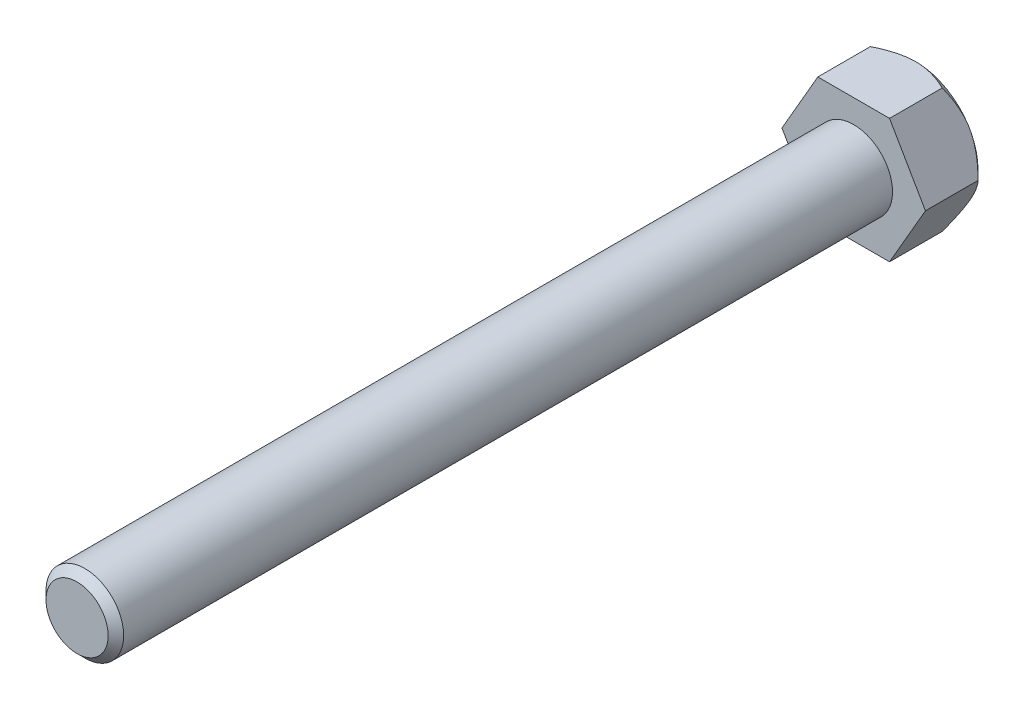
ISO-10303-21;
HEADER;
FILE_DESCRIPTION(('STEP AP214'),'2;1');
FILE_NAME('part.step','',(''),(''),'','','');
FILE_SCHEMA(('AUTOMOTIVE_DESIGN { 1 0 10303 214 1 1 1 1 }'));
ENDSEC;
DATA;
#1=APPLICATION_CONTEXT('core data for automotive mechanical design processes');
#2=APPLICATION_PROTOCOL_DEFINITION('international standard','automotive_design',2000,#1);
#3=PRODUCT_CONTEXT('',#1,'mechanical');
#4=PRODUCT('Part','Part','',(#3));
#5=PRODUCT_RELATED_PRODUCT_CATEGORY('part','',(#4));
#6=PRODUCT_DEFINITION_FORMATION('','',#4);
#7=PRODUCT_DEFINITION_CONTEXT('part definition',#1,'design');
#8=PRODUCT_DEFINITION('design','',#6,#7);
#9=PRODUCT_DEFINITION_SHAPE('','',#8);
#10=(LENGTH_UNIT() NAMED_UNIT(*) SI_UNIT(.MILLI.,.METRE.));
#11=(NAMED_UNIT(*) PLANE_ANGLE_UNIT() SI_UNIT($,.RADIAN.));
#12=(NAMED_UNIT(*) SI_UNIT($,.STERADIAN.) SOLID_ANGLE_UNIT());
#13=UNCERTAINTY_MEASURE_WITH_UNIT(LENGTH_MEASURE(1.E-05),#10,'distance_accuracy_value','');
#14=(GEOMETRIC_REPRESENTATION_CONTEXT(3) GLOBAL_UNCERTAINTY_ASSIGNED_CONTEXT((#13)) GLOBAL_UNIT_ASSIGNED_CONTEXT((#10,
#11,#12)) REPRESENTATION_CONTEXT('',''));
#15=CARTESIAN_POINT('',(0.,0.,0.));
#16=DIRECTION('',(0.,0.,1.));
#17=DIRECTION('',(1.,0.,0.));
#18=AXIS2_PLACEMENT_3D('',#15,#16,#17);
#19=CARTESIAN_POINT('',(2.3094010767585,-4.00000000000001,4.));
#20=DIRECTION('',(-0.866025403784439,0.5,0.));
#21=DIRECTION('',(-0.5,-0.866025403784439,0.));
#22=AXIS2_PLACEMENT_3D('',#19,#20,#21);
#23=PLANE('',#22);
#24=CARTESIAN_POINT('',(6.23305633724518,2.79597026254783,2.82801284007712));
#25=CARTESIAN_POINT('',(6.17835989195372,2.7012332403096,2.73934369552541));
#26=CARTESIAN_POINT('',(6.12344684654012,2.60612105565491,2.6512041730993));
#27=CARTESIAN_POINT('',(6.01311260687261,2.4150165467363,2.47618696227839));
#28=CARTESIAN_POINT('',(5.95769136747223,2.3190241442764,2.38930938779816));
#29=CARTESIAN_POINT('',(5.8461445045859,2.12581931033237,2.21683197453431));
#30=CARTESIAN_POINT('',(5.79001753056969,2.02860453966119,2.13123562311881));
#31=CARTESIAN_POINT('',(5.67710269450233,1.83303030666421,1.96180822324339));
#32=CARTESIAN_POINT('',(5.62031485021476,1.73467087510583,1.87797712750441));
#33=CARTESIAN_POINT('',(5.50440203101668,1.5339039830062,1.71013938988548));
#34=CARTESIAN_POINT('',(5.4452557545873,1.43145962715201,1.62619145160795));
#35=CARTESIAN_POINT('',(5.32603106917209,1.22495641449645,1.4609883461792));
#36=CARTESIAN_POINT('',(5.26595269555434,1.1208976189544,1.37973307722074));
#37=CARTESIAN_POINT('',(5.14476310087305,0.910991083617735,1.22057920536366));
#38=CARTESIAN_POINT('',(5.08365279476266,0.805144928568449,1.14267782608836));
#39=CARTESIAN_POINT('',(4.96018805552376,0.591297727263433,0.99094029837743));
#40=CARTESIAN_POINT('',(4.8978337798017,0.483296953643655,0.917103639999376));
#41=CARTESIAN_POINT('',(4.76998399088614,0.261854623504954,0.772552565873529));
#42=CARTESIAN_POINT('',(4.70444912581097,0.148344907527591,0.701976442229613));
#43=CARTESIAN_POINT('',(4.57165447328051,-0.0816621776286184,0.56753175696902));
#44=CARTESIAN_POINT('',(4.50439444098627,-0.198159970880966,0.503664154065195));
#45=CARTESIAN_POINT('',(4.36836758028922,-0.433765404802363,0.384737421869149));
#46=CARTESIAN_POINT('',(4.29961082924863,-0.552855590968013,0.3296326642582));
#47=CARTESIAN_POINT('',(4.16020651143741,-0.794310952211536,0.229941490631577));
#48=CARTESIAN_POINT('',(4.08955952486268,-0.916675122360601,0.185351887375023));
#49=CARTESIAN_POINT('',(3.96058423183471,-1.14006688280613,0.116499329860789));
#50=CARTESIAN_POINT('',(3.90256086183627,-1.24056630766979,0.0899643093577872));
#51=CARTESIAN_POINT('',(3.78562938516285,-1.44309756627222,0.0463155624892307));
#52=CARTESIAN_POINT('',(3.72672140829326,-1.54512917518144,0.0292004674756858));
#53=CARTESIAN_POINT('',(3.60848332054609,-1.74992355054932,0.00527037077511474));
#54=CARTESIAN_POINT('',(3.5491541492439,-1.85268468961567,-0.00156293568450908));
#55=CARTESIAN_POINT('',(3.43042577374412,-2.0583282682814,-0.00461227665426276));
#56=CARTESIAN_POINT('',(3.37102656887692,-2.16121070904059,-0.000828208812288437));
#57=CARTESIAN_POINT('',(3.25278300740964,-2.36601456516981,0.017123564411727));
#58=CARTESIAN_POINT('',(3.19393761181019,-2.46793778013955,0.0312643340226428));
#59=CARTESIAN_POINT('',(3.07702437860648,-2.67043744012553,0.0691728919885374));
#60=CARTESIAN_POINT('',(3.01895672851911,-2.77101356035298,0.0929429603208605));
#61=CARTESIAN_POINT('',(2.90370727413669,-2.97063147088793,0.149127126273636));
#62=CARTESIAN_POINT('',(2.84652859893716,-3.06966784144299,0.181566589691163));
#63=CARTESIAN_POINT('',(2.73337155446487,-3.26566159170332,0.253854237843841));
#64=CARTESIAN_POINT('',(2.67739312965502,-3.36261906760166,0.293702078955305));
#65=CARTESIAN_POINT('',(2.54711533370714,-3.58826682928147,0.394806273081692));
#66=CARTESIAN_POINT('',(2.47332098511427,-3.71608239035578,0.458655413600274));
#67=CARTESIAN_POINT('',(2.32781431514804,-3.96810733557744,0.595286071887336));
#68=CARTESIAN_POINT('',(2.25610311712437,-4.09231477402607,0.668072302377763));
#69=CARTESIAN_POINT('',(2.11441297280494,-4.33772930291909,0.820726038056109));
#70=CARTESIAN_POINT('',(2.04443792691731,-4.45892963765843,0.900607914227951));
#71=CARTESIAN_POINT('',(1.90613088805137,-4.69848445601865,1.06578250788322));
#72=CARTESIAN_POINT('',(1.83779860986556,-4.8168394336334,1.15107427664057));
#73=CARTESIAN_POINT('',(1.70220901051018,-5.05168750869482,1.32633967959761));
#74=CARTESIAN_POINT('',(1.63495814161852,-5.16816943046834,1.41633318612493));
#75=CARTESIAN_POINT('',(1.50163856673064,-5.39908570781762,1.59976782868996));
#76=CARTESIAN_POINT('',(1.43556996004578,-5.51351989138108,1.69320925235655));
#77=CARTESIAN_POINT('',(1.30451081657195,-5.74052098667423,1.88276529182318));
#78=CARTESIAN_POINT('',(1.23951918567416,-5.85308979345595,1.97887689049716));
#79=CARTESIAN_POINT('',(1.11038848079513,-6.07675073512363,2.17336534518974));
#80=CARTESIAN_POINT('',(1.0462494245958,-6.18784283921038,2.27174224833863));
#81=CARTESIAN_POINT('',(0.934092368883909,-6.3821045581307,2.44639645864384));
#82=CARTESIAN_POINT('',(0.885919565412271,-6.46554230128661,2.52227719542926));
#83=CARTESIAN_POINT('',(0.790160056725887,-6.63140263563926,2.67464512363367));
#84=CARTESIAN_POINT('',(0.742571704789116,-6.71382807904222,2.75112817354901));
#85=CARTESIAN_POINT('',(0.695146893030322,-6.79597026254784,2.82801284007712));
#86=B_SPLINE_CURVE_WITH_KNOTS('',3,(#24,#25,#26,#27,#28,#29,#30,#31,#32,#33,#34,#35,#36,#37,#38,
#39,#40,#41,#42,#43,#44,#45,#46,#47,#48,#49,#50,#51,#52,#53,#54,#55,#56,#57,#58,#59,#60,#61,#62,
#63,#64,#65,#66,#67,#68,#69,#70,#71,#72,#73,#74,#75,#76,#77,#78,#79,#80,#81,#82,#83,#84,#85),
.UNSPECIFIED.,.F.,.F.,(4,2,2,2,2,2,2,2,2,2,2,2,2,2,2,2,2,2,2,2,2,2,2,2,2,2,2,2,2,2,4),(0.,
0.422449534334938,0.84493696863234,1.26841847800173,1.6918886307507,2.1270169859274,
2.56212887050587,2.99687335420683,3.43156317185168,3.87799967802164,4.32449989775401,
4.76859314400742,5.21255160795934,5.56933787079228,5.92607228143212,6.2821708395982,
6.63827283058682,6.99345194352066,7.34871520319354,7.70502952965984,8.06132733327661,
8.54334615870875,9.02562026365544,9.50889442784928,9.99208407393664,10.4775138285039,
10.9629841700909,11.4479266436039,11.9328792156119,12.3007909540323,12.6670827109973),.UNSPECIFIED.);
#87=CARTESIAN_POINT('',(4.61880215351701,0.,0.615384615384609));
#88=VERTEX_POINT('',#87);
#89=CARTESIAN_POINT('',(3.54679379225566,-1.8567729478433,0.));
#90=VERTEX_POINT('',#89);
#91=EDGE_CURVE('E194',#88,#90,#86,.T.);
#92=ORIENTED_EDGE('',*,*,#91,.F.);
#93=DIRECTION('',(0.,0.,-1.));
#94=VECTOR('',#93,1.);
#95=CARTESIAN_POINT('',(4.61880215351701,0.,4.));
#96=LINE('',#95,#94);
#97=CARTESIAN_POINT('',(4.61880215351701,0.,4.));
#98=VERTEX_POINT('',#97);
#99=EDGE_CURVE('E161',#98,#88,#96,.T.);
#100=ORIENTED_EDGE('',*,*,#99,.F.);
#101=DIRECTION('',(0.5,0.866025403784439,0.));
#102=VECTOR('',#101,1.);
#103=CARTESIAN_POINT('',(2.3094010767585,-4.00000000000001,4.));
#104=LINE('',#103,#102);
#105=CARTESIAN_POINT('',(2.3094010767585,-4.00000000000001,4.));
#106=VERTEX_POINT('',#105);
#107=EDGE_CURVE('E216',#106,#98,#104,.T.);
#108=ORIENTED_EDGE('',*,*,#107,.F.);
#109=DIRECTION('',(0.,0.,-1.));
#110=VECTOR('',#109,1.);
#111=CARTESIAN_POINT('',(2.3094010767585,-4.00000000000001,4.));
#112=LINE('',#111,#110);
#113=CARTESIAN_POINT('',(2.30940107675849,-4.00000000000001,0.615384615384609));
#114=VERTEX_POINT('',#113);
#115=EDGE_CURVE('E155',#106,#114,#112,.T.);
#116=ORIENTED_EDGE('',*,*,#115,.T.);
#117=CARTESIAN_POINT('',(3.38140943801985,-2.1432270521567,0.));
#118=VERTEX_POINT('',#117);
#119=EDGE_CURVE('E129',#118,#114,#86,.T.);
#120=ORIENTED_EDGE('',*,*,#119,.F.);
#121=DIRECTION('',(0.5,0.866025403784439,0.));
#122=VECTOR('',#121,1.);
#123=CARTESIAN_POINT('',(2.3094010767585,-4.00000000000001,0.));
#124=LINE('',#123,#122);
#125=EDGE_CURVE('E190',#118,#90,#124,.T.);
#126=ORIENTED_EDGE('',*,*,#125,.T.);
#127=EDGE_LOOP('',(#92,#100,#108,#116,#120,#126));
#128=FACE_BOUND('',#127,.T.);
#129=ADVANCED_FACE('F31',(#128),#23,.F.);
#130=CARTESIAN_POINT('',(4.61880215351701,0.,4.));
#131=DIRECTION('',(-0.866025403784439,-0.5,0.));
#132=DIRECTION('',(0.5,-0.866025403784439,0.));
#133=AXIS2_PLACEMENT_3D('',#130,#131,#132);
#134=PLANE('',#133);
#135=CARTESIAN_POINT('',(0.695146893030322,6.79597026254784,2.82801284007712));
#136=CARTESIAN_POINT('',(0.749843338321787,6.70123324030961,2.73934369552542));
#137=CARTESIAN_POINT('',(0.804756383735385,6.60612105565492,2.65120417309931));
#138=CARTESIAN_POINT('',(0.915090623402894,6.41501654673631,2.4761869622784));
#139=CARTESIAN_POINT('',(0.97051186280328,6.31902414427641,2.38930938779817));
#140=CARTESIAN_POINT('',(1.0820587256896,6.12581931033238,2.21683197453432));
#141=CARTESIAN_POINT('',(1.13818569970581,6.02860453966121,2.13123562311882));
#142=CARTESIAN_POINT('',(1.25110053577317,5.83303030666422,1.9618082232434));
#143=CARTESIAN_POINT('',(1.30788838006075,5.73467087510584,1.87797712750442));
#144=CARTESIAN_POINT('',(1.42380119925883,5.53390398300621,1.71013938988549));
#145=CARTESIAN_POINT('',(1.4829474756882,5.43145962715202,1.62619145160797));
#146=CARTESIAN_POINT('',(1.60217216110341,5.22495641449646,1.46098834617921));
#147=CARTESIAN_POINT('',(1.66225053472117,5.12089761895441,1.37973307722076));
#148=CARTESIAN_POINT('',(1.78344012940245,4.91099108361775,1.22057920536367));
#149=CARTESIAN_POINT('',(1.84455043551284,4.80514492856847,1.14267782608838));
#150=CARTESIAN_POINT('',(1.96801517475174,4.59129772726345,0.990940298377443));
#151=CARTESIAN_POINT('',(2.0303694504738,4.48329695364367,0.917103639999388));
#152=CARTESIAN_POINT('',(2.15821923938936,4.26185462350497,0.77255256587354));
#153=CARTESIAN_POINT('',(2.22375410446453,4.14834490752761,0.701976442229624));
#154=CARTESIAN_POINT('',(2.35654875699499,3.9183378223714,0.56753175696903));
#155=CARTESIAN_POINT('',(2.42380878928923,3.80184002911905,0.503664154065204));
#156=CARTESIAN_POINT('',(2.55983564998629,3.56623459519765,0.384737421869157));
#157=CARTESIAN_POINT('',(2.62859240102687,3.447144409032,0.329632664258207));
#158=CARTESIAN_POINT('',(2.7679967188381,3.20568904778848,0.229941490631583));
#159=CARTESIAN_POINT('',(2.83864370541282,3.08332487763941,0.185351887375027));
#160=CARTESIAN_POINT('',(2.9676189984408,2.85993311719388,0.116499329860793));
#161=CARTESIAN_POINT('',(3.02564236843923,2.75943369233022,0.0899643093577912));
#162=CARTESIAN_POINT('',(3.14257384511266,2.55690243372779,0.046315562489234));
#163=CARTESIAN_POINT('',(3.20148182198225,2.45487082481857,0.0292004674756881));
#164=CARTESIAN_POINT('',(3.31971990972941,2.25007644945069,0.00527037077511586));
#165=CARTESIAN_POINT('',(3.3790490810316,2.14731531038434,-0.00156293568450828));
#166=CARTESIAN_POINT('',(3.49777745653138,1.94167173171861,-0.00461227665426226));
#167=CARTESIAN_POINT('',(3.55717666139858,1.83878929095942,-0.000828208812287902));
#168=CARTESIAN_POINT('',(3.67542022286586,1.6339854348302,0.0171235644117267));
#169=CARTESIAN_POINT('',(3.73426561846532,1.53206221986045,0.0312643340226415));
#170=CARTESIAN_POINT('',(3.85117885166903,1.32956255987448,0.0691728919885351));
#171=CARTESIAN_POINT('',(3.9092465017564,1.22898643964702,0.0929429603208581));
#172=CARTESIAN_POINT('',(4.02449595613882,1.02936852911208,0.149127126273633));
#173=CARTESIAN_POINT('',(4.08167463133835,0.930332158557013,0.181566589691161));
#174=CARTESIAN_POINT('',(4.19483167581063,0.734338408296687,0.253854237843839));
#175=CARTESIAN_POINT('',(4.25081010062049,0.637380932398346,0.293702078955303));
#176=CARTESIAN_POINT('',(4.38108789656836,0.411733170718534,0.394806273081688));
#177=CARTESIAN_POINT('',(4.45488224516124,0.283917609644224,0.458655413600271));
#178=CARTESIAN_POINT('',(4.60038891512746,0.0318926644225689,0.595286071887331));
#179=CARTESIAN_POINT('',(4.67210011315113,-0.0923147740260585,0.668072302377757));
#180=CARTESIAN_POINT('',(4.81379025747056,-0.337729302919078,0.820726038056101));
#181=CARTESIAN_POINT('',(4.88376530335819,-0.458929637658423,0.900607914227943));
#182=CARTESIAN_POINT('',(5.02207234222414,-0.69848445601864,1.06578250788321));
#183=CARTESIAN_POINT('',(5.09040462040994,-0.816839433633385,1.15107427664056));
#184=CARTESIAN_POINT('',(5.22599421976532,-1.05168750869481,1.3263396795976));
#185=CARTESIAN_POINT('',(5.29324508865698,-1.16816943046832,1.41633318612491));
#186=CARTESIAN_POINT('',(5.42656466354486,-1.3990857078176,1.59976782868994));
#187=CARTESIAN_POINT('',(5.49263327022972,-1.51351989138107,1.69320925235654));
#188=CARTESIAN_POINT('',(5.62369241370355,-1.74052098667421,1.88276529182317));
#189=CARTESIAN_POINT('',(5.68868404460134,-1.85308979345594,1.97887689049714));
#190=CARTESIAN_POINT('',(5.81781474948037,-2.07675073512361,2.17336534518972));
#191=CARTESIAN_POINT('',(5.8819538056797,-2.18784283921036,2.27174224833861));
#192=CARTESIAN_POINT('',(5.99411086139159,-2.38210455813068,2.44639645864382));
#193=CARTESIAN_POINT('',(6.04228366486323,-2.46554230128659,2.52227719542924));
#194=CARTESIAN_POINT('',(6.13804317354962,-2.63140263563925,2.67464512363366));
#195=CARTESIAN_POINT('',(6.18563152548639,-2.71382807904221,2.751128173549));
#196=CARTESIAN_POINT('',(6.23305633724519,-2.79597026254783,2.82801284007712));
#197=B_SPLINE_CURVE_WITH_KNOTS('',3,(#135,#136,#137,#138,#139,#140,#141,#142,#143,#144,#145,
#146,#147,#148,#149,#150,#151,#152,#153,#154,#155,#156,#157,#158,#159,#160,#161,#162,#163,#164,
#165,#166,#167,#168,#169,#170,#171,#172,#173,#174,#175,#176,#177,#178,#179,#180,#181,#182,#183,
#184,#185,#186,#187,#188,#189,#190,#191,#192,#193,#194,#195,#196),.UNSPECIFIED.,.F.,.F.,(4,2,2,
2,2,2,2,2,2,2,2,2,2,2,2,2,2,2,2,2,2,2,2,2,2,2,2,2,2,2,4),(0.,0.422449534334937,
0.844936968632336,1.26841847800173,1.6918886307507,2.12701698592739,2.56212887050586,
2.99687335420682,3.43156317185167,3.87799967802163,4.32449989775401,4.76859314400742,
5.21255160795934,5.56933787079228,5.92607228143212,6.2821708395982,6.63827283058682,
6.99345194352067,7.34871520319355,7.70502952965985,8.06132733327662,8.54334615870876,
9.02562026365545,9.50889442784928,9.99208407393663,10.4775138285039,10.9629841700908,
11.4479266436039,11.9328792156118,12.3007909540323,12.6670827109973),.UNSPECIFIED.);
#198=CARTESIAN_POINT('',(2.30940107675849,4.00000000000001,0.615384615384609));
#199=VERTEX_POINT('',#198);
#200=CARTESIAN_POINT('',(3.38140943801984,2.14322705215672,0.));
#201=VERTEX_POINT('',#200);
#202=EDGE_CURVE('E46',#199,#201,#197,.T.);
#203=ORIENTED_EDGE('',*,*,#202,.F.);
#204=DIRECTION('',(0.,0.,-1.));
#205=VECTOR('',#204,1.);
#206=CARTESIAN_POINT('',(2.3094010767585,4.00000000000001,4.));
#207=LINE('',#206,#205);
#208=CARTESIAN_POINT('',(2.3094010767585,4.00000000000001,4.));
#209=VERTEX_POINT('',#208);
#210=EDGE_CURVE('E152',#209,#199,#207,.T.);
#211=ORIENTED_EDGE('',*,*,#210,.F.);
#212=DIRECTION('',(-0.5,0.866025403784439,0.));
#213=VECTOR('',#212,1.);
#214=CARTESIAN_POINT('',(4.61880215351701,0.,4.));
#215=LINE('',#214,#213);
#216=EDGE_CURVE('E225',#98,#209,#215,.T.);
#217=ORIENTED_EDGE('',*,*,#216,.F.);
#218=ORIENTED_EDGE('',*,*,#99,.T.);
#219=CARTESIAN_POINT('',(3.54679379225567,1.85677294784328,0.));
#220=VERTEX_POINT('',#219);
#221=EDGE_CURVE('E234',#220,#88,#197,.T.);
#222=ORIENTED_EDGE('',*,*,#221,.F.);
#223=DIRECTION('',(-0.5,0.866025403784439,0.));
#224=VECTOR('',#223,1.);
#225=CARTESIAN_POINT('',(4.61880215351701,0.,0.));
#226=LINE('',#225,#224);
#227=EDGE_CURVE('E198',#220,#201,#226,.T.);
#228=ORIENTED_EDGE('',*,*,#227,.T.);
#229=EDGE_LOOP('',(#203,#211,#217,#218,#222,#228));
#230=FACE_BOUND('',#229,.T.);
#231=ADVANCED_FACE('F240',(#230),#134,.F.);
#232=CARTESIAN_POINT('',(2.3094010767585,4.00000000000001,4.));
#233=DIRECTION('',(0.,-1.,0.));
#234=DIRECTION('',(1.,0.,0.));
#235=AXIS2_PLACEMENT_3D('',#232,#233,#234);
#236=PLANE('',#235);
#237=CARTESIAN_POINT('',(-5.10537133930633,4.00000000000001,2.48232193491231));
#238=CARTESIAN_POINT('',(-4.99107134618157,4.00000000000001,2.39236445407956));
#239=CARTESIAN_POINT('',(-4.87622346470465,4.00000000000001,2.30309422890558));
#240=CARTESIAN_POINT('',(-4.64522047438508,4.00000000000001,2.12622342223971));
#241=CARTESIAN_POINT('',(-4.52906515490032,4.00000000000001,2.03862311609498));
#242=CARTESIAN_POINT('',(-4.29468593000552,4.00000000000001,1.86498189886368));
#243=CARTESIAN_POINT('',(-4.17645456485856,4.00000000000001,1.77895103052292));
#244=CARTESIAN_POINT('',(-3.93826053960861,4.00000000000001,1.60932693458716));
#245=CARTESIAN_POINT('',(-3.81829796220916,4.00000000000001,1.52573359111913));
#246=CARTESIAN_POINT('',(-3.57038197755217,4.00000000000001,1.35745298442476));
#247=CARTESIAN_POINT('',(-3.44232649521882,4.00000000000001,1.27291553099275));
#248=CARTESIAN_POINT('',(-3.18362899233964,4.00000000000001,1.10790004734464));
#249=CARTESIAN_POINT('',(-3.05298718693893,4.00000000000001,1.0274216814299));
#250=CARTESIAN_POINT('',(-2.78893252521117,4.00000000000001,0.871702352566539));
#251=CARTESIAN_POINT('',(-2.6555253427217,4.00000000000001,0.796451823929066));
#252=CARTESIAN_POINT('',(-2.38529285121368,4.00000000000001,0.652391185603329));
#253=CARTESIAN_POINT('',(-2.24846847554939,4.00000000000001,0.583579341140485));
#254=CARTESIAN_POINT('',(-1.98529180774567,4.00000000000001,0.460804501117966));
#255=CARTESIAN_POINT('',(-1.85931525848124,4.00000000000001,0.40604199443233));
#256=CARTESIAN_POINT('',(-1.60408237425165,4.00000000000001,0.304641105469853));
#257=CARTESIAN_POINT('',(-1.4748257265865,4.00000000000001,0.258003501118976));
#258=CARTESIAN_POINT('',(-1.21458926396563,4.00000000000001,0.175122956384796));
#259=CARTESIAN_POINT('',(-1.08364549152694,4.00000000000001,0.13876837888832));
#260=CARTESIAN_POINT('',(-0.819107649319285,4.00000000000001,0.077563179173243));
#261=CARTESIAN_POINT('',(-0.685514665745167,4.00000000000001,0.0527079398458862));
#262=CARTESIAN_POINT('',(-0.41398619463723,4.00000000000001,0.0156595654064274));
#263=CARTESIAN_POINT('',(-0.276016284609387,4.00000000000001,0.00371325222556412));
#264=CARTESIAN_POINT('',(0.000415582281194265,4.00000000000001,-0.00580250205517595));
#265=CARTESIAN_POINT('',(0.138877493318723,4.00000000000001,-0.00337324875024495));
#266=CARTESIAN_POINT('',(0.415213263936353,4.00000000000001,0.0157037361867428));
#267=CARTESIAN_POINT('',(0.553084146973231,4.00000000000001,0.032393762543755));
#268=CARTESIAN_POINT('',(0.826587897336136,4.00000000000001,0.0788679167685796));
#269=CARTESIAN_POINT('',(0.962220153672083,4.00000000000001,0.108655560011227));
#270=CARTESIAN_POINT('',(1.27145954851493,4.00000000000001,0.190396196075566));
#271=CARTESIAN_POINT('',(1.44400277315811,4.00000000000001,0.246341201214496));
#272=CARTESIAN_POINT('',(1.78341610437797,4.00000000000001,0.373308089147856));
#273=CARTESIAN_POINT('',(1.95028276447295,4.00000000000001,0.444338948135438));
#274=CARTESIAN_POINT('',(2.27983021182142,4.00000000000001,0.598348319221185));
#275=CARTESIAN_POINT('',(2.44247121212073,4.00000000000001,0.681410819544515));
#276=CARTESIAN_POINT('',(2.76293118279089,4.00000000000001,0.856187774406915));
#277=CARTESIAN_POINT('',(2.92075125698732,4.00000000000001,0.947900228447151));
#278=CARTESIAN_POINT('',(3.25568101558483,4.00000000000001,1.15209259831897));
#279=CARTESIAN_POINT('',(3.43214379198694,4.00000000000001,1.26562664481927));
#280=CARTESIAN_POINT('',(3.78080075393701,4.00000000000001,1.49910125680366));
#281=CARTESIAN_POINT('',(3.95299395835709,4.00000000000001,1.6190432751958));
#282=CARTESIAN_POINT('',(4.29008176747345,4.00000000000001,1.8609963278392));
#283=CARTESIAN_POINT('',(4.45505343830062,4.00000000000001,1.98290043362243));
#284=CARTESIAN_POINT('',(4.7004233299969,4.00000000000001,2.16838347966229));
#285=CARTESIAN_POINT('',(4.78183731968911,4.00000000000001,2.23062680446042));
#286=CARTESIAN_POINT('',(4.944049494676,4.00000000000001,2.35590440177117));
#287=CARTESIAN_POINT('',(5.02484770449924,4.00000000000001,2.41893864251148));
#288=CARTESIAN_POINT('',(5.10537133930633,4.00000000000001,2.48232193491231));
#289=B_SPLINE_CURVE_WITH_KNOTS('',3,(#237,#238,#239,#240,#241,#242,#243,#244,#245,#246,#247,
#248,#249,#250,#251,#252,#253,#254,#255,#256,#257,#258,#259,#260,#261,#262,#263,#264,#265,#266,
#267,#268,#269,#270,#271,#272,#273,#274,#275,#276,#277,#278,#279,#280,#281,#282,#283,#284,#285,
#286,#287,#288),.UNSPECIFIED.,.F.,.F.,(4,2,2,2,2,2,2,2,2,2,2,2,2,2,2,2,2,2,2,2,2,2,2,2,2,4),(0.,
0.436367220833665,0.872805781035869,1.31143651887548,1.7500463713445,2.21031446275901,
2.67054442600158,3.12990880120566,3.58914905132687,4.00101511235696,4.41292058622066,
4.82016568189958,5.22724712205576,5.64198138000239,6.05667797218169,6.4726087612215,
6.8886512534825,7.43185630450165,7.97538547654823,8.52291009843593,9.07030840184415,
9.69960915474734,10.3290532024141,10.9443638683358,11.2518047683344,11.5592333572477),.UNSPECIFIED.);
#290=CARTESIAN_POINT('',(-2.30940107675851,3.99999999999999,0.615384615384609));
#291=VERTEX_POINT('',#290);
#292=CARTESIAN_POINT('',(-0.16538435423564,4.00000000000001,0.));
#293=VERTEX_POINT('',#292);
#294=EDGE_CURVE('E54',#291,#293,#289,.T.);
#295=ORIENTED_EDGE('',*,*,#294,.F.);
#296=DIRECTION('',(0.,0.,-1.));
#297=VECTOR('',#296,1.);
#298=CARTESIAN_POINT('',(-2.3094010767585,4.00000000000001,4.));
#299=LINE('',#298,#297);
#300=CARTESIAN_POINT('',(-2.3094010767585,4.00000000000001,4.));
#301=VERTEX_POINT('',#300);
#302=EDGE_CURVE('E148',#301,#291,#299,.T.);
#303=ORIENTED_EDGE('',*,*,#302,.F.);
#304=DIRECTION('',(-1.,0.,0.));
#305=VECTOR('',#304,1.);
#306=CARTESIAN_POINT('',(2.3094010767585,4.00000000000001,4.));
#307=LINE('',#306,#305);
#308=EDGE_CURVE('E221',#209,#301,#307,.T.);
#309=ORIENTED_EDGE('',*,*,#308,.F.);
#310=ORIENTED_EDGE('',*,*,#210,.T.);
#311=CARTESIAN_POINT('',(0.165384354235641,4.00000000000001,0.));
#312=VERTEX_POINT('',#311);
#313=EDGE_CURVE('E235',#312,#199,#289,.T.);
#314=ORIENTED_EDGE('',*,*,#313,.F.);
#315=DIRECTION('',(-1.,0.,0.));
#316=VECTOR('',#315,1.);
#317=CARTESIAN_POINT('',(2.3094010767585,4.00000000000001,0.));
#318=LINE('',#317,#316);
#319=EDGE_CURVE('E202',#312,#293,#318,.T.);
#320=ORIENTED_EDGE('',*,*,#319,.T.);
#321=EDGE_LOOP('',(#295,#303,#309,#310,#314,#320));
#322=FACE_BOUND('',#321,.T.);
#323=ADVANCED_FACE('F275',(#322),#236,.F.);
#324=CARTESIAN_POINT('',(-2.3094010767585,4.00000000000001,4.));
#325=DIRECTION('',(0.866025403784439,-0.5,0.));
#326=DIRECTION('',(0.5,0.866025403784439,0.));
#327=AXIS2_PLACEMENT_3D('',#324,#325,#326);
#328=PLANE('',#327);
#329=CARTESIAN_POINT('',(-6.23305633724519,-2.79597026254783,2.82801284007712));
#330=CARTESIAN_POINT('',(-6.17835989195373,-2.7012332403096,2.73934369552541));
#331=CARTESIAN_POINT('',(-6.12344684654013,-2.60612105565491,2.65120417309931));
#332=CARTESIAN_POINT('',(-6.01311260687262,-2.4150165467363,2.4761869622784));
#333=CARTESIAN_POINT('',(-5.95769136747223,-2.3190241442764,2.38930938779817));
#334=CARTESIAN_POINT('',(-5.84614450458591,-2.12581931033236,2.21683197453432));
#335=CARTESIAN_POINT('',(-5.7900175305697,-2.02860453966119,2.13123562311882));
#336=CARTESIAN_POINT('',(-5.67710269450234,-1.83303030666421,1.9618082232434));
#337=CARTESIAN_POINT('',(-5.62031485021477,-1.73467087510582,1.87797712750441));
#338=CARTESIAN_POINT('',(-5.50440203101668,-1.5339039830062,1.71013938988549));
#339=CARTESIAN_POINT('',(-5.44525575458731,-1.43145962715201,1.62619145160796));
#340=CARTESIAN_POINT('',(-5.32603106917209,-1.22495641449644,1.46098834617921));
#341=CARTESIAN_POINT('',(-5.26595269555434,-1.12089761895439,1.37973307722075));
#342=CARTESIAN_POINT('',(-5.14476310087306,-0.910991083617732,1.22057920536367));
#343=CARTESIAN_POINT('',(-5.08365279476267,-0.805144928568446,1.14267782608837));
#344=CARTESIAN_POINT('',(-4.96018805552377,-0.59129772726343,0.990940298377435));
#345=CARTESIAN_POINT('',(-4.8978337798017,-0.483296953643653,0.91710363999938));
#346=CARTESIAN_POINT('',(-4.76998399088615,-0.261854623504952,0.772552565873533));
#347=CARTESIAN_POINT('',(-4.70444912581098,-0.148344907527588,0.701976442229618));
#348=CARTESIAN_POINT('',(-4.57165447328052,0.081662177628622,0.567531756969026));
#349=CARTESIAN_POINT('',(-4.50439444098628,0.19815997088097,0.5036641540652));
#350=CARTESIAN_POINT('',(-4.36836758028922,0.433765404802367,0.384737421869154));
#351=CARTESIAN_POINT('',(-4.29961082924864,0.552855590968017,0.329632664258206));
#352=CARTESIAN_POINT('',(-4.16020651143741,0.794310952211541,0.229941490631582));
#353=CARTESIAN_POINT('',(-4.08955952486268,0.916675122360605,0.185351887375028));
#354=CARTESIAN_POINT('',(-3.96058423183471,1.14006688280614,0.116499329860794));
#355=CARTESIAN_POINT('',(-3.90256086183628,1.24056630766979,0.0899643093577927));
#356=CARTESIAN_POINT('',(-3.78562938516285,1.44309756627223,0.0463155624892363));
#357=CARTESIAN_POINT('',(-3.72672140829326,1.54512917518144,0.029200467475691));
#358=CARTESIAN_POINT('',(-3.60848332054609,1.74992355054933,0.0052703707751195));
#359=CARTESIAN_POINT('',(-3.54915414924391,1.85268468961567,-0.00156293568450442));
#360=CARTESIAN_POINT('',(-3.43042577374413,2.0583282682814,-0.00461227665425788));
#361=CARTESIAN_POINT('',(-3.37102656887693,2.16121070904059,-0.000828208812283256));
#362=CARTESIAN_POINT('',(-3.25278300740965,2.36601456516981,0.0171235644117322));
#363=CARTESIAN_POINT('',(-3.19393761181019,2.46793778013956,0.0312643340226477));
#364=CARTESIAN_POINT('',(-3.07702437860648,2.67043744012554,0.069172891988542));
#365=CARTESIAN_POINT('',(-3.01895672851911,2.77101356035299,0.0929429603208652));
#366=CARTESIAN_POINT('',(-2.90370727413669,2.97063147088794,0.149127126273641));
#367=CARTESIAN_POINT('',(-2.84652859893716,3.069667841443,0.181566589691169));
#368=CARTESIAN_POINT('',(-2.73337155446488,3.26566159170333,0.253854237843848));
#369=CARTESIAN_POINT('',(-2.67739312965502,3.36261906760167,0.293702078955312));
#370=CARTESIAN_POINT('',(-2.54711533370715,3.58826682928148,0.394806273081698));
#371=CARTESIAN_POINT('',(-2.47332098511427,3.71608239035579,0.458655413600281));
#372=CARTESIAN_POINT('',(-2.32781431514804,3.96810733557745,0.595286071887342));
#373=CARTESIAN_POINT('',(-2.25610311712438,4.09231477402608,0.66807230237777));
#374=CARTESIAN_POINT('',(-2.11441297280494,4.3377293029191,0.820726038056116));
#375=CARTESIAN_POINT('',(-2.04443792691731,4.45892963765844,0.900607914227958));
#376=CARTESIAN_POINT('',(-1.90613088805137,4.69848445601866,1.06578250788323));
#377=CARTESIAN_POINT('',(-1.83779860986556,4.81683943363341,1.15107427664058));
#378=CARTESIAN_POINT('',(-1.70220901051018,5.05168750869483,1.32633967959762));
#379=CARTESIAN_POINT('',(-1.63495814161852,5.16816943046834,1.41633318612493));
#380=CARTESIAN_POINT('',(-1.50163856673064,5.39908570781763,1.59976782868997));
#381=CARTESIAN_POINT('',(-1.43556996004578,5.51351989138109,1.69320925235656));
#382=CARTESIAN_POINT('',(-1.30451081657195,5.74052098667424,1.88276529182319));
#383=CARTESIAN_POINT('',(-1.23951918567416,5.85308979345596,1.97887689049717));
#384=CARTESIAN_POINT('',(-1.11038848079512,6.07675073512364,2.17336534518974));
#385=CARTESIAN_POINT('',(-1.04624942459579,6.18784283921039,2.27174224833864));
#386=CARTESIAN_POINT('',(-0.934092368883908,6.38210455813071,2.44639645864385));
#387=CARTESIAN_POINT('',(-0.88591956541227,6.46554230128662,2.52227719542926));
#388=CARTESIAN_POINT('',(-0.790160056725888,6.63140263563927,2.67464512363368));
#389=CARTESIAN_POINT('',(-0.742571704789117,6.71382807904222,2.75112817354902));
#390=CARTESIAN_POINT('',(-0.695146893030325,6.79597026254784,2.82801284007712));
#391=B_SPLINE_CURVE_WITH_KNOTS('',3,(#329,#330,#331,#332,#333,#334,#335,#336,#337,#338,#339,
#340,#341,#342,#343,#344,#345,#346,#347,#348,#349,#350,#351,#352,#353,#354,#355,#356,#357,#358,
#359,#360,#361,#362,#363,#364,#365,#366,#367,#368,#369,#370,#371,#372,#373,#374,#375,#376,#377,
#378,#379,#380,#381,#382,#383,#384,#385,#386,#387,#388,#389,#390),.UNSPECIFIED.,.F.,.F.,(4,2,2,
2,2,2,2,2,2,2,2,2,2,2,2,2,2,2,2,2,2,2,2,2,2,2,2,2,2,2,4),(0.,0.422449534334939,
0.844936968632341,1.26841847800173,1.69188863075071,2.1270169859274,2.56212887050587,
2.99687335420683,3.43156317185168,3.87799967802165,4.32449989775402,4.76859314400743,
5.21255160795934,5.56933787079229,5.92607228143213,6.2821708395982,6.63827283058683,
6.99345194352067,7.34871520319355,7.70502952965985,8.06132733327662,8.54334615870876,
9.02562026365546,9.5088944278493,9.99208407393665,10.477513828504,10.9629841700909,
11.4479266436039,11.9328792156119,12.3007909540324,12.6670827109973),.UNSPECIFIED.);
#392=CARTESIAN_POINT('',(-4.61880215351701,0.,0.615384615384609));
#393=VERTEX_POINT('',#392);
#394=CARTESIAN_POINT('',(-3.5467937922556,1.85677294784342,0.));
#395=VERTEX_POINT('',#394);
#396=EDGE_CURVE('E122',#393,#395,#391,.T.);
#397=ORIENTED_EDGE('',*,*,#396,.F.);
#398=DIRECTION('',(0.,0.,-1.));
#399=VECTOR('',#398,1.);
#400=CARTESIAN_POINT('',(-4.61880215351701,0.,4.));
#401=LINE('',#400,#399);
#402=CARTESIAN_POINT('',(-4.61880215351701,0.,4.));
#403=VERTEX_POINT('',#402);
#404=EDGE_CURVE('E137',#403,#393,#401,.T.);
#405=ORIENTED_EDGE('',*,*,#404,.F.);
#406=DIRECTION('',(-0.5,-0.866025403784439,0.));
#407=VECTOR('',#406,1.);
#408=CARTESIAN_POINT('',(-2.3094010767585,4.00000000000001,4.));
#409=LINE('',#408,#407);
#410=EDGE_CURVE('E220',#301,#403,#409,.T.);
#411=ORIENTED_EDGE('',*,*,#410,.F.);
#412=ORIENTED_EDGE('',*,*,#302,.T.);
#413=CARTESIAN_POINT('',(-3.38140943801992,2.14322705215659,0.));
#414=VERTEX_POINT('',#413);
#415=EDGE_CURVE('E142',#414,#291,#391,.T.);
#416=ORIENTED_EDGE('',*,*,#415,.F.);
#417=DIRECTION('',(-0.5,-0.866025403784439,0.));
#418=VECTOR('',#417,1.);
#419=CARTESIAN_POINT('',(-2.3094010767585,4.00000000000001,0.));
#420=LINE('',#419,#418);
#421=EDGE_CURVE('E141',#414,#395,#420,.T.);
#422=ORIENTED_EDGE('',*,*,#421,.T.);
#423=EDGE_LOOP('',(#397,#405,#411,#412,#416,#422));
#424=FACE_BOUND('',#423,.T.);
#425=ADVANCED_FACE('F135',(#424),#328,.F.);
#426=CARTESIAN_POINT('',(-4.61880215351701,0.,4.));
#427=DIRECTION('',(0.866025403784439,0.5,0.));
#428=DIRECTION('',(-0.5,0.866025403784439,0.));
#429=AXIS2_PLACEMENT_3D('',#426,#427,#428);
#430=PLANE('',#429);
#431=CARTESIAN_POINT('',(-0.695146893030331,-6.79597026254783,2.82801284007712));
#432=CARTESIAN_POINT('',(-0.749843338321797,-6.7012332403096,2.73934369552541));
#433=CARTESIAN_POINT('',(-0.804756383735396,-6.60612105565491,2.6512041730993));
#434=CARTESIAN_POINT('',(-0.915090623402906,-6.41501654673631,2.4761869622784));
#435=CARTESIAN_POINT('',(-0.970511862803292,-6.3190241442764,2.38930938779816));
#436=CARTESIAN_POINT('',(-1.08205872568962,-6.12581931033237,2.21683197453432));
#437=CARTESIAN_POINT('',(-1.13818569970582,-6.0286045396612,2.13123562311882));
#438=CARTESIAN_POINT('',(-1.25110053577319,-5.83303030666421,1.96180822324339));
#439=CARTESIAN_POINT('',(-1.30788838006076,-5.73467087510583,1.87797712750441));
#440=CARTESIAN_POINT('',(-1.42380119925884,-5.5339039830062,1.71013938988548));
#441=CARTESIAN_POINT('',(-1.48294747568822,-5.43145962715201,1.62619145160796));
#442=CARTESIAN_POINT('',(-1.60217216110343,-5.22495641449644,1.4609883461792));
#443=CARTESIAN_POINT('',(-1.66225053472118,-5.12089761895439,1.37973307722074));
#444=CARTESIAN_POINT('',(-1.78344012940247,-4.91099108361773,1.22057920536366));
#445=CARTESIAN_POINT('',(-1.84455043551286,-4.80514492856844,1.14267782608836));
#446=CARTESIAN_POINT('',(-1.96801517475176,-4.59129772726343,0.99094029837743));
#447=CARTESIAN_POINT('',(-2.03036945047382,-4.48329695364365,0.917103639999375));
#448=CARTESIAN_POINT('',(-2.15821923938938,-4.26185462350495,0.772552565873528));
#449=CARTESIAN_POINT('',(-2.22375410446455,-4.14834490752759,0.701976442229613));
#450=CARTESIAN_POINT('',(-2.35654875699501,-3.91833782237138,0.567531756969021));
#451=CARTESIAN_POINT('',(-2.42380878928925,-3.80184002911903,0.503664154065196));
#452=CARTESIAN_POINT('',(-2.55983564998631,-3.56623459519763,0.384737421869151));
#453=CARTESIAN_POINT('',(-2.62859240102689,-3.44714440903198,0.329632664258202));
#454=CARTESIAN_POINT('',(-2.76799671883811,-3.20568904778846,0.22994149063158));
#455=CARTESIAN_POINT('',(-2.83864370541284,-3.08332487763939,0.185351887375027));
#456=CARTESIAN_POINT('',(-2.96761899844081,-2.85993311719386,0.116499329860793));
#457=CARTESIAN_POINT('',(-3.02564236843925,-2.75943369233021,0.0899643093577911));
#458=CARTESIAN_POINT('',(-3.14257384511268,-2.55690243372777,0.046315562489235));
#459=CARTESIAN_POINT('',(-3.20148182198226,-2.45487082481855,0.0292004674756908));
#460=CARTESIAN_POINT('',(-3.31971990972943,-2.25007644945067,0.00527037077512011));
#461=CARTESIAN_POINT('',(-3.37904908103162,-2.14731531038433,-0.00156293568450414));
#462=CARTESIAN_POINT('',(-3.4977774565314,-1.94167173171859,-0.00461227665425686));
#463=CARTESIAN_POINT('',(-3.5571766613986,-1.83878929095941,-0.00082820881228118));
#464=CARTESIAN_POINT('',(-3.67542022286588,-1.63398543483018,0.0171235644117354));
#465=CARTESIAN_POINT('',(-3.73426561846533,-1.53206221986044,0.0312643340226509));
#466=CARTESIAN_POINT('',(-3.85117885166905,-1.32956255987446,0.0691728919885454));
#467=CARTESIAN_POINT('',(-3.90924650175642,-1.22898643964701,0.0929429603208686));
#468=CARTESIAN_POINT('',(-4.02449595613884,-1.02936852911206,0.149127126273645));
#469=CARTESIAN_POINT('',(-4.08167463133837,-0.930332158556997,0.181566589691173));
#470=CARTESIAN_POINT('',(-4.19483167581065,-0.734338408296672,0.253854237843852));
#471=CARTESIAN_POINT('',(-4.2508101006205,-0.637380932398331,0.293702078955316));
#472=CARTESIAN_POINT('',(-4.38108789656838,-0.411733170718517,0.394806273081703));
#473=CARTESIAN_POINT('',(-4.45488224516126,-0.283917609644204,0.458655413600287));
#474=CARTESIAN_POINT('',(-4.60038891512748,-0.0318926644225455,0.595286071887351));
#475=CARTESIAN_POINT('',(-4.67210011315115,0.0923147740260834,0.668072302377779));
#476=CARTESIAN_POINT('',(-4.81379025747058,0.337729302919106,0.820726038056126));
#477=CARTESIAN_POINT('',(-4.88376530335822,0.458929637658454,0.90060791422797));
#478=CARTESIAN_POINT('',(-5.02207234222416,0.698484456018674,1.06578250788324));
#479=CARTESIAN_POINT('',(-5.09040462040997,0.816839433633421,1.15107427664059));
#480=CARTESIAN_POINT('',(-5.22599421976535,1.05168750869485,1.32633967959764));
#481=CARTESIAN_POINT('',(-5.29324508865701,1.16816943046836,1.41633318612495));
#482=CARTESIAN_POINT('',(-5.42656466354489,1.39908570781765,1.59976782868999));
#483=CARTESIAN_POINT('',(-5.49263327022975,1.51351989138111,1.69320925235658));
#484=CARTESIAN_POINT('',(-5.62369241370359,1.74052098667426,1.88276529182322));
#485=CARTESIAN_POINT('',(-5.68868404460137,1.85308979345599,1.97887689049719));
#486=CARTESIAN_POINT('',(-5.81781474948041,2.07675073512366,2.17336534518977));
#487=CARTESIAN_POINT('',(-5.88195380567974,2.18784283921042,2.27174224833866));
#488=CARTESIAN_POINT('',(-5.99411086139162,2.38210455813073,2.44639645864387));
#489=CARTESIAN_POINT('',(-6.04228366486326,2.46554230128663,2.52227719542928));
#490=CARTESIAN_POINT('',(-6.13804317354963,2.63140263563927,2.67464512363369));
#491=CARTESIAN_POINT('',(-6.1856315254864,2.71382807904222,2.75112817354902));
#492=CARTESIAN_POINT('',(-6.23305633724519,2.79597026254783,2.82801284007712));
#493=B_SPLINE_CURVE_WITH_KNOTS('',3,(#431,#432,#433,#434,#435,#436,#437,#438,#439,#440,#441,
#442,#443,#444,#445,#446,#447,#448,#449,#450,#451,#452,#453,#454,#455,#456,#457,#458,#459,#460,
#461,#462,#463,#464,#465,#466,#467,#468,#469,#470,#471,#472,#473,#474,#475,#476,#477,#478,#479,
#480,#481,#482,#483,#484,#485,#486,#487,#488,#489,#490,#491,#492),.UNSPECIFIED.,.F.,.F.,(4,2,2,
2,2,2,2,2,2,2,2,2,2,2,2,2,2,2,2,2,2,2,2,2,2,2,2,2,2,2,4),(0.,0.422449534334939,
0.844936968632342,1.26841847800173,1.69188863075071,2.1270169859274,2.56212887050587,
2.99687335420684,3.43156317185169,3.87799967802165,4.32449989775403,4.76859314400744,
5.21255160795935,5.56933787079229,5.92607228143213,6.28217083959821,6.63827283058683,
6.99345194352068,7.34871520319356,7.70502952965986,8.06132733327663,8.54334615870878,
9.02562026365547,9.50889442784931,9.99208407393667,10.477513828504,10.9629841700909,
11.4479266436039,11.9328792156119,12.3007909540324,12.6670827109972),.UNSPECIFIED.);
#494=CARTESIAN_POINT('',(-2.30940107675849,-4.00000000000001,0.615384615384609));
#495=VERTEX_POINT('',#494);
#496=CARTESIAN_POINT('',(-3.38140943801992,-2.14322705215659,0.));
#497=VERTEX_POINT('',#496);
#498=EDGE_CURVE('E131',#495,#497,#493,.T.);
#499=ORIENTED_EDGE('',*,*,#498,.F.);
#500=DIRECTION('',(0.,0.,-1.));
#501=VECTOR('',#500,1.);
#502=CARTESIAN_POINT('',(-2.30940107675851,-4.00000000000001,4.));
#503=LINE('',#502,#501);
#504=CARTESIAN_POINT('',(-2.30940107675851,-4.00000000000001,4.));
#505=VERTEX_POINT('',#504);
#506=EDGE_CURVE('E149',#505,#495,#503,.T.);
#507=ORIENTED_EDGE('',*,*,#506,.F.);
#508=DIRECTION('',(0.5,-0.866025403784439,0.));
#509=VECTOR('',#508,1.);
#510=CARTESIAN_POINT('',(-4.61880215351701,0.,4.));
#511=LINE('',#510,#509);
#512=EDGE_CURVE('E147',#403,#505,#511,.T.);
#513=ORIENTED_EDGE('',*,*,#512,.F.);
#514=ORIENTED_EDGE('',*,*,#404,.T.);
#515=CARTESIAN_POINT('',(-3.5467937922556,-1.85677294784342,0.));
#516=VERTEX_POINT('',#515);
#517=EDGE_CURVE('E119',#516,#393,#493,.T.);
#518=ORIENTED_EDGE('',*,*,#517,.F.);
#519=DIRECTION('',(0.5,-0.866025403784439,0.));
#520=VECTOR('',#519,1.);
#521=CARTESIAN_POINT('',(-4.61880215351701,0.,0.));
#522=LINE('',#521,#520);
#523=EDGE_CURVE('E213',#516,#497,#522,.T.);
#524=ORIENTED_EDGE('',*,*,#523,.T.);
#525=EDGE_LOOP('',(#499,#507,#513,#514,#518,#524));
#526=FACE_BOUND('',#525,.T.);
#527=ADVANCED_FACE('F145',(#526),#430,.F.);
#528=CARTESIAN_POINT('',(-2.30940107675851,-4.00000000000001,4.));
#529=DIRECTION('',(0.,1.,0.));
#530=DIRECTION('',(-1.,0.,0.));
#531=AXIS2_PLACEMENT_3D('',#528,#529,#530);
#532=PLANE('',#531);
#533=CARTESIAN_POINT('',(5.10537133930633,-4.00000000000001,2.48232193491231));
#534=CARTESIAN_POINT('',(4.99107134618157,-4.00000000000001,2.39236445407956));
#535=CARTESIAN_POINT('',(4.87622346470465,-4.00000000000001,2.30309422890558));
#536=CARTESIAN_POINT('',(4.64522047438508,-4.00000000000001,2.12622342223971));
#537=CARTESIAN_POINT('',(4.52906515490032,-4.00000000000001,2.03862311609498));
#538=CARTESIAN_POINT('',(4.29468593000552,-4.00000000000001,1.86498189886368));
#539=CARTESIAN_POINT('',(4.17645456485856,-4.00000000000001,1.77895103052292));
#540=CARTESIAN_POINT('',(3.93826053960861,-4.00000000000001,1.60932693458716));
#541=CARTESIAN_POINT('',(3.81829796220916,-4.00000000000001,1.52573359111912));
#542=CARTESIAN_POINT('',(3.57038197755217,-4.00000000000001,1.35745298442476));
#543=CARTESIAN_POINT('',(3.44232649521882,-4.00000000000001,1.27291553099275));
#544=CARTESIAN_POINT('',(3.18362899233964,-4.00000000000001,1.10790004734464));
#545=CARTESIAN_POINT('',(3.05298718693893,-4.00000000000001,1.02742168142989));
#546=CARTESIAN_POINT('',(2.78893252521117,-4.00000000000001,0.871702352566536));
#547=CARTESIAN_POINT('',(2.6555253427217,-4.00000000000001,0.796451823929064));
#548=CARTESIAN_POINT('',(2.38529285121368,-4.00000000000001,0.652391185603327));
#549=CARTESIAN_POINT('',(2.24846847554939,-4.00000000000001,0.583579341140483));
#550=CARTESIAN_POINT('',(1.98529180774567,-4.00000000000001,0.460804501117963));
#551=CARTESIAN_POINT('',(1.85931525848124,-4.00000000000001,0.406041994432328));
#552=CARTESIAN_POINT('',(1.60408237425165,-4.00000000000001,0.30464110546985));
#553=CARTESIAN_POINT('',(1.4748257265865,-4.00000000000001,0.258003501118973));
#554=CARTESIAN_POINT('',(1.21458926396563,-4.00000000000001,0.175122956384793));
#555=CARTESIAN_POINT('',(1.08364549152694,-4.00000000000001,0.138768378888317));
#556=CARTESIAN_POINT('',(0.819107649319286,-4.00000000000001,0.0775631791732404));
#557=CARTESIAN_POINT('',(0.685514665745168,-4.00000000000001,0.0527079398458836));
#558=CARTESIAN_POINT('',(0.41398619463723,-4.00000000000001,0.0156595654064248));
#559=CARTESIAN_POINT('',(0.276016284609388,-4.00000000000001,0.00371325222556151));
#560=CARTESIAN_POINT('',(-0.000415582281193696,-4.00000000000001,-0.00580250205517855));
#561=CARTESIAN_POINT('',(-0.138877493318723,-4.00000000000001,-0.00337324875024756));
#562=CARTESIAN_POINT('',(-0.415213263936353,-4.00000000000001,0.0157037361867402));
#563=CARTESIAN_POINT('',(-0.55308414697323,-4.00000000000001,0.0323937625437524));
#564=CARTESIAN_POINT('',(-0.826587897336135,-4.00000000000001,0.0788679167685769));
#565=CARTESIAN_POINT('',(-0.962220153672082,-4.00000000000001,0.108655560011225));
#566=CARTESIAN_POINT('',(-1.27145954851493,-4.00000000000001,0.190396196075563));
#567=CARTESIAN_POINT('',(-1.44400277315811,-4.00000000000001,0.246341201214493));
#568=CARTESIAN_POINT('',(-1.78341610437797,-4.00000000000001,0.373308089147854));
#569=CARTESIAN_POINT('',(-1.95028276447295,-4.00000000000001,0.444338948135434));
#570=CARTESIAN_POINT('',(-2.27983021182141,-4.00000000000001,0.598348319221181));
#571=CARTESIAN_POINT('',(-2.44247121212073,-4.00000000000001,0.68141081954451));
#572=CARTESIAN_POINT('',(-2.76293118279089,-4.00000000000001,0.856187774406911));
#573=CARTESIAN_POINT('',(-2.92075125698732,-4.00000000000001,0.947900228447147));
#574=CARTESIAN_POINT('',(-3.25568101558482,-4.00000000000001,1.15209259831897));
#575=CARTESIAN_POINT('',(-3.43214379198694,-4.00000000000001,1.26562664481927));
#576=CARTESIAN_POINT('',(-3.78080075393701,-4.00000000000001,1.49910125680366));
#577=CARTESIAN_POINT('',(-3.9529939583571,-4.00000000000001,1.6190432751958));
#578=CARTESIAN_POINT('',(-4.29008176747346,-4.00000000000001,1.8609963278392));
#579=CARTESIAN_POINT('',(-4.45505343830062,-4.00000000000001,1.98290043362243));
#580=CARTESIAN_POINT('',(-4.70042332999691,-4.00000000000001,2.1683834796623));
#581=CARTESIAN_POINT('',(-4.78183731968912,-4.,2.23062680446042));
#582=CARTESIAN_POINT('',(-4.94404949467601,-4.,2.35590440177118));
#583=CARTESIAN_POINT('',(-5.02484770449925,-4.,2.41893864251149));
#584=CARTESIAN_POINT('',(-5.10537133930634,-4.,2.48232193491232));
#585=B_SPLINE_CURVE_WITH_KNOTS('',3,(#533,#534,#535,#536,#537,#538,#539,#540,#541,#542,#543,
#544,#545,#546,#547,#548,#549,#550,#551,#552,#553,#554,#555,#556,#557,#558,#559,#560,#561,#562,
#563,#564,#565,#566,#567,#568,#569,#570,#571,#572,#573,#574,#575,#576,#577,#578,#579,#580,#581,
#582,#583,#584),.UNSPECIFIED.,.F.,.F.,(4,2,2,2,2,2,2,2,2,2,2,2,2,2,2,2,2,2,2,2,2,2,2,2,2,4),(0.,
0.436367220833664,0.872805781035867,1.31143651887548,1.7500463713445,2.21031446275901,
2.67054442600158,3.12990880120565,3.58914905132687,4.00101511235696,4.41292058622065,
4.82016568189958,5.22724712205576,5.64198138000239,6.05667797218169,6.4726087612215,
6.8886512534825,7.43185630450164,7.97538547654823,8.52291009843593,9.07030840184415,
9.69960915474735,10.3290532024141,10.9443638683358,11.2518047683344,11.5592333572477),.UNSPECIFIED.);
#586=CARTESIAN_POINT('',(0.165384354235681,-4.00000000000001,0.));
#587=VERTEX_POINT('',#586);
#588=EDGE_CURVE('E181',#114,#587,#585,.T.);
#589=ORIENTED_EDGE('',*,*,#588,.F.);
#590=ORIENTED_EDGE('',*,*,#115,.F.);
#591=DIRECTION('',(1.,0.,0.));
#592=VECTOR('',#591,1.);
#593=CARTESIAN_POINT('',(-2.30940107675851,-4.00000000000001,4.));
#594=LINE('',#593,#592);
#595=EDGE_CURVE('E207',#505,#106,#594,.T.);
#596=ORIENTED_EDGE('',*,*,#595,.F.);
#597=ORIENTED_EDGE('',*,*,#506,.T.);
#598=CARTESIAN_POINT('',(-0.165384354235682,-4.00000000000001,0.));
#599=VERTEX_POINT('',#598);
#600=EDGE_CURVE('E254',#599,#495,#585,.T.);
#601=ORIENTED_EDGE('',*,*,#600,.F.);
#602=DIRECTION('',(1.,0.,0.));
#603=VECTOR('',#602,1.);
#604=CARTESIAN_POINT('',(-2.30940107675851,-4.00000000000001,0.));
#605=LINE('',#604,#603);
#606=EDGE_CURVE('E215',#599,#587,#605,.T.);
#607=ORIENTED_EDGE('',*,*,#606,.T.);
#608=EDGE_LOOP('',(#589,#590,#596,#597,#601,#607));
#609=FACE_BOUND('',#608,.T.);
#610=ADVANCED_FACE('F312',(#609),#532,.F.);
#611=CARTESIAN_POINT('',(6.92820323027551,4.00000000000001,0.));
#612=DIRECTION('',(0.,0.,1.));
#613=DIRECTION('',(1.,0.,0.));
#614=AXIS2_PLACEMENT_3D('',#611,#612,#613);
#615=PLANE('',#614);
#616=CARTESIAN_POINT('',(0.,0.,0.));
#617=DIRECTION('',(0.,0.,1.));
#618=DIRECTION('',(1.,0.,0.));
#619=AXIS2_PLACEMENT_3D('',#616,#617,#618);
#620=CIRCLE('',#619,4.00341753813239);
#621=EDGE_CURVE('E166',#201,#312,#620,.T.);
#622=ORIENTED_EDGE('',*,*,#621,.F.);
#623=ORIENTED_EDGE('',*,*,#227,.F.);
#624=EDGE_CURVE('E164',#90,#220,#620,.T.);
#625=ORIENTED_EDGE('',*,*,#624,.F.);
#626=ORIENTED_EDGE('',*,*,#125,.F.);
#627=EDGE_CURVE('E165',#587,#118,#620,.T.);
#628=ORIENTED_EDGE('',*,*,#627,.F.);
#629=ORIENTED_EDGE('',*,*,#606,.F.);
#630=EDGE_CURVE('E172',#497,#599,#620,.T.);
#631=ORIENTED_EDGE('',*,*,#630,.F.);
#632=ORIENTED_EDGE('',*,*,#523,.F.);
#633=EDGE_CURVE('E124',#395,#516,#620,.T.);
#634=ORIENTED_EDGE('',*,*,#633,.F.);
#635=ORIENTED_EDGE('',*,*,#421,.F.);
#636=EDGE_CURVE('E170',#293,#414,#620,.T.);
#637=ORIENTED_EDGE('',*,*,#636,.F.);
#638=ORIENTED_EDGE('',*,*,#319,.F.);
#639=EDGE_LOOP('',(#622,#623,#625,#626,#628,#629,#631,#632,#634,#635,#637,#638));
#640=FACE_BOUND('',#639,.T.);
#641=ADVANCED_FACE('F196',(#640),#615,.F.);
#642=CARTESIAN_POINT('',(6.92820323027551,4.00000000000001,4.));
#643=DIRECTION('',(0.,0.,1.));
#644=DIRECTION('',(1.,0.,0.));
#645=AXIS2_PLACEMENT_3D('',#642,#643,#644);
#646=PLANE('',#645);
#647=ORIENTED_EDGE('',*,*,#107,.T.);
#648=ORIENTED_EDGE('',*,*,#216,.T.);
#649=ORIENTED_EDGE('',*,*,#308,.T.);
#650=ORIENTED_EDGE('',*,*,#410,.T.);
#651=ORIENTED_EDGE('',*,*,#512,.T.);
#652=ORIENTED_EDGE('',*,*,#595,.T.);
#653=EDGE_LOOP('',(#647,#648,#649,#650,#651,#652));
#654=FACE_BOUND('',#653,.T.);
#655=CARTESIAN_POINT('',(0.,0.,4.));
#656=DIRECTION('',(0.,0.,1.));
#657=DIRECTION('',(1.,0.,0.));
#658=AXIS2_PLACEMENT_3D('',#655,#656,#657);
#659=CIRCLE('',#658,2.5);
#660=CARTESIAN_POINT('',(2.5,0.,4.));
#661=VERTEX_POINT('',#660);
#662=EDGE_CURVE('E199',#661,#661,#659,.T.);
#663=ORIENTED_EDGE('',*,*,#662,.F.);
#664=EDGE_LOOP('',(#663));
#665=FACE_BOUND('',#664,.T.);
#666=ADVANCED_FACE('F328',(#654,#665),#646,.T.);
#667=CARTESIAN_POINT('',(0.,0.,54.));
#668=DIRECTION('',(0.,0.,-1.));
#669=DIRECTION('',(-1.,0.,0.));
#670=AXIS2_PLACEMENT_3D('',#667,#668,#669);
#671=CYLINDRICAL_SURFACE('',#670,2.5);
#672=CARTESIAN_POINT('',(0.,0.,53.5));
#673=DIRECTION('',(0.,0.,1.));
#674=DIRECTION('',(1.,0.,0.));
#675=AXIS2_PLACEMENT_3D('',#672,#673,#674);
#676=CIRCLE('',#675,2.5);
#677=CARTESIAN_POINT('',(2.5,0.,53.5));
#678=VERTEX_POINT('',#677);
#679=EDGE_CURVE('E11',#678,#678,#676,.F.);
#680=ORIENTED_EDGE('',*,*,#679,.T.);
#681=EDGE_LOOP('',(#680));
#682=FACE_BOUND('',#681,.T.);
#683=ORIENTED_EDGE('',*,*,#662,.T.);
#684=EDGE_LOOP('',(#683));
#685=FACE_BOUND('',#684,.T.);
#686=ADVANCED_FACE('F380',(#682,#685),#671,.T.);
#687=CARTESIAN_POINT('',(0.,0.,54.));
#688=DIRECTION('',(0.,0.,1.));
#689=DIRECTION('',(1.,0.,0.));
#690=AXIS2_PLACEMENT_3D('',#687,#688,#689);
#691=PLANE('',#690);
#692=CARTESIAN_POINT('',(0.,0.,54.));
#693=DIRECTION('',(0.,0.,1.));
#694=DIRECTION('',(1.,0.,0.));
#695=AXIS2_PLACEMENT_3D('',#692,#693,#694);
#696=CIRCLE('',#695,1.99999999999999);
#697=CARTESIAN_POINT('',(1.99999999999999,0.,54.));
#698=VERTEX_POINT('',#697);
#699=EDGE_CURVE('E39',#698,#698,#696,.T.);
#700=ORIENTED_EDGE('',*,*,#699,.T.);
#701=EDGE_LOOP('',(#700));
#702=FACE_BOUND('',#701,.T.);
#703=ADVANCED_FACE('F246',(#702),#691,.T.);
#704=CARTESIAN_POINT('',(0.,0.,0.));
#705=DIRECTION('',(0.,0.,1.));
#706=DIRECTION('',(1.,0.,0.));
#707=AXIS2_PLACEMENT_3D('',#704,#705,#706);
#708=CONICAL_SURFACE('',#707,4.00341753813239,0.785398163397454);
#709=ORIENTED_EDGE('',*,*,#91,.T.);
#710=ORIENTED_EDGE('',*,*,#624,.T.);
#711=ORIENTED_EDGE('',*,*,#221,.T.);
#712=EDGE_LOOP('',(#709,#710,#711));
#713=FACE_BOUND('',#712,.T.);
#714=ADVANCED_FACE('F242',(#713),#708,.T.);
#715=ORIENTED_EDGE('',*,*,#119,.T.);
#716=ORIENTED_EDGE('',*,*,#588,.T.);
#717=ORIENTED_EDGE('',*,*,#627,.T.);
#718=EDGE_LOOP('',(#715,#716,#717));
#719=FACE_BOUND('',#718,.T.);
#720=ADVANCED_FACE('F179',(#719),#708,.T.);
#721=ORIENTED_EDGE('',*,*,#498,.T.);
#722=ORIENTED_EDGE('',*,*,#630,.T.);
#723=ORIENTED_EDGE('',*,*,#600,.T.);
#724=EDGE_LOOP('',(#721,#722,#723));
#725=FACE_BOUND('',#724,.T.);
#726=ADVANCED_FACE('F249',(#725),#708,.T.);
#727=ORIENTED_EDGE('',*,*,#396,.T.);
#728=ORIENTED_EDGE('',*,*,#633,.T.);
#729=ORIENTED_EDGE('',*,*,#517,.T.);
#730=EDGE_LOOP('',(#727,#728,#729));
#731=FACE_BOUND('',#730,.T.);
#732=ADVANCED_FACE('F121',(#731),#708,.T.);
#733=ORIENTED_EDGE('',*,*,#294,.T.);
#734=ORIENTED_EDGE('',*,*,#636,.T.);
#735=ORIENTED_EDGE('',*,*,#415,.T.);
#736=EDGE_LOOP('',(#733,#734,#735));
#737=FACE_BOUND('',#736,.T.);
#738=ADVANCED_FACE('F360',(#737),#708,.T.);
#739=ORIENTED_EDGE('',*,*,#202,.T.);
#740=ORIENTED_EDGE('',*,*,#621,.T.);
#741=ORIENTED_EDGE('',*,*,#313,.T.);
#742=EDGE_LOOP('',(#739,#740,#741));
#743=FACE_BOUND('',#742,.T.);
#744=ADVANCED_FACE('F248',(#743),#708,.T.);
#745=CARTESIAN_POINT('',(0.,0.,54.));
#746=DIRECTION('',(0.,0.,-1.));
#747=DIRECTION('',(-1.,0.,0.));
#748=AXIS2_PLACEMENT_3D('',#745,#746,#747);
#749=CONICAL_SURFACE('',#748,1.99999999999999,0.785398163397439);
#750=ORIENTED_EDGE('',*,*,#679,.F.);
#751=EDGE_LOOP('',(#750));
#752=FACE_BOUND('',#751,.T.);
#753=ORIENTED_EDGE('',*,*,#699,.F.);
#754=EDGE_LOOP('',(#753));
#755=FACE_BOUND('',#754,.T.);
#756=ADVANCED_FACE('F33',(#752,#755),#749,.T.);
#757=CLOSED_SHELL('',(#129,#231,#323,#425,#527,#610,#641,#666,#686,#703,#714,#720,#726,#732,
#738,#744,#756));
#758=MANIFOLD_SOLID_BREP('B2',#757);
#759=ADVANCED_BREP_SHAPE_REPRESENTATION('',(#18,#758),#14);
#760=SHAPE_DEFINITION_REPRESENTATION(#9,#759);
ENDSEC;
END-ISO-10303-21;
